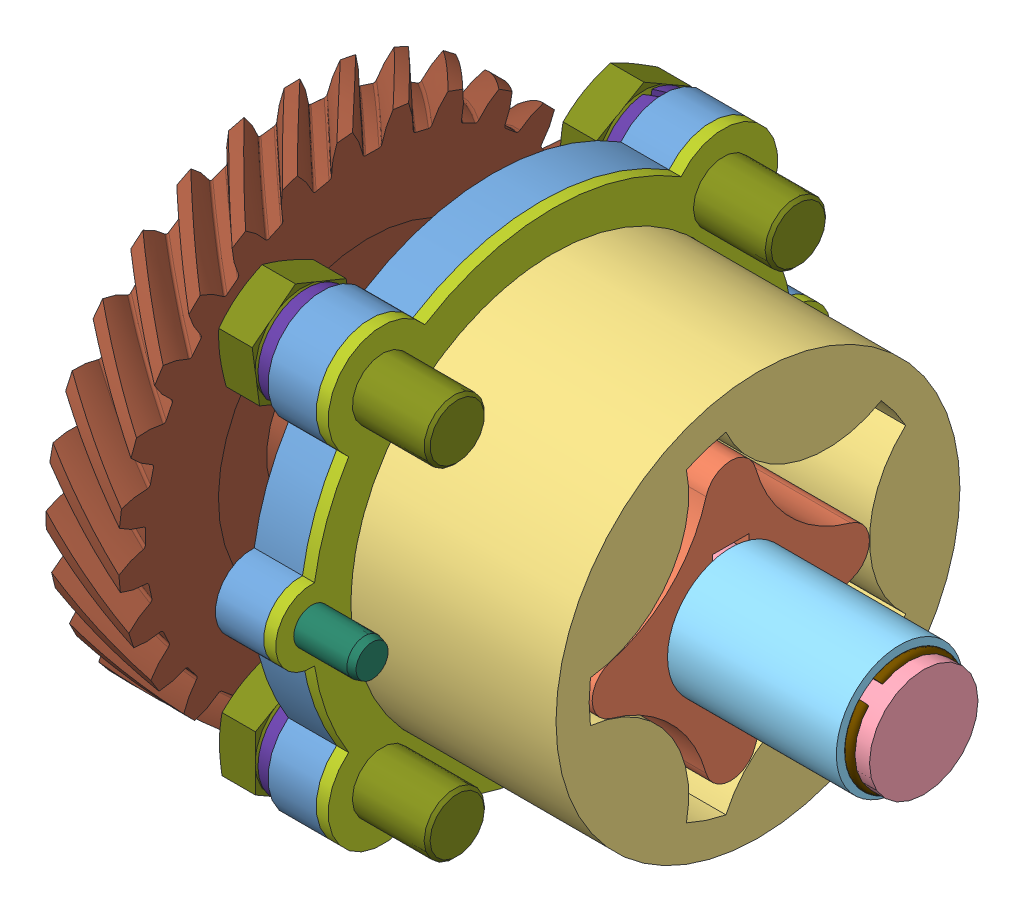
SolidWorks assembly 摆线转子泵.SLDASM, configuration 默认 (file format 3400). Lengths in mm.
Overall size (122 90.82 95.91).
26 component instances, 19 part files, 73 mates.
Components (placement in the parent):
- 泵体-1: 泵体.SLDPRT [默认] at origin size (66 97.5 150) (hidden)
- 泵盖-1: 泵盖.SLDPRT [默认] at (-62 0 0) x (0 0 1) z (-1 0 0) size (92 80 16)
- 内转子-1: 内转子.SLDPRT [默认] at (-28 0 0) x (0 0 1) z (-1 0 0) size (46 46 36)
- 外转子-1: 外转子.SLDPRT [默认] at (-28 0 0) x (0 0 1) z (-1 0 0) size (67 67 36)
- 泵轴-1: 泵轴.SLDPRT [默认] x (0 0 -1) z (1 0 0) size (18 18 122)
- 轴套1-1: 轴套1.SLDPRT [默认] x (0 0 -1) z (1 0 0) size (21 21 28)
- 轴套2-1: 轴套2.SLDPRT [默认] at (-72 0 0) x (0 0 1) z (-1 0 0) size (21 21 8)
- 垫片-1: 垫片.SLDPRT [默认] at (-62 0 0) x (0 0 1) z (-1 0 0) size (92 80 2)
- 键2-1: 键2.SLDPRT [默认] at (0 5 0) x (0 0 1) z (0 1 0) size (5 12 4)
- 键1-1: 键1.SLDPRT [默认] at (0 7 0) x (0 0 1) z (0 1 0) size (6 26 4)
- 止推轴衬-1: 止推轴衬.SLDPRT [默认] at (-82 0 0) x (0 0 1) z (-1 0 0) size (29 29 2)
- 斜齿轮.SLDPRT.lnk-1: 斜齿轮.SLDPRT.lnk.SLDPRT [ISO - RH Helical gear 2M 28T 45HA 20PA 12FW ---28A75H50L0.8N] at (-100 0 4.5) x (1 0 0) z (0 0.093312 0.995637) size (18 83.4 83.4)
- 垫圈1-1: 垫圈1.SLDPRT [默认] at (-97 0 4.5) x (0 0.093312 0.995637) z (-1 0 0) size (15 15 1)
- 螺母M12-1: 螺母M12.SLDPRT [GB_FASTENER_NUT_SNNAB1 M12 YB-N] at (-114.8 0 4.5) x (0 -0.5 0.866025) z (-1 0 0) size (20.78 18 15.8)
- 开口销-1: 开口销.SLDPRT [GB_CONNECTING_PIECE_PIN_AP 3.2X22] at (-111.925 0 20.8262) x (0 0 -1) z (0.619272 0.785177 0) size (31.6 5.8 2.9)
- 圆柱销-1: 圆柱销.SLDPRT [GB_CONNECTING_PIECE_PIN_PPUS 6X20] at (-72 0 40) x (1 0 0) z (0 0.371336 -0.928499) size (20 6 6)
- 圆柱销-2: 圆柱销.SLDPRT [GB_CONNECTING_PIECE_PIN_PPUS 6X20] at (-72 0 -40) x (1 0 0) z (0 0.371336 -0.928499) size (20 6 6)
- 螺栓-1: 螺栓.sldprt [GB_FASTENER_BOLT_STBAB A M10X25-N] at (-81.18 28.2843 28.2843) x (1 0 0) z (0 -0.134968 0.99085) size (31.58 18.16 15.73)
- 垫圈-1: 垫圈.SLDPRT [GB_FASTENER_WASHER_SW 10] at (-74.6 28.2843 28.2843) x (0 -0.815355 -0.578962) z (-1 0 0) size (16.1 16.1 2.6)
- 螺栓-2: 螺栓.sldprt [GB_FASTENER_BOLT_STBAB A M10X25-N] at (-81.18 28.2843 -28.2843) size (31.58 18.16 15.73)
- 垫圈-2: 垫圈.SLDPRT [GB_FASTENER_WASHER_SW 10] at (-72 28.2843 -28.2843) x (0 -0.090155 -0.995928) z (1 0 0) size (16.1 16.1 2.6)
- 垫圈-3: 垫圈.SLDPRT [GB_FASTENER_WASHER_SW 10] at (-72 -28.2843 -28.2843) x (0 -0.090155 -0.995928) z (1 0 0) size (16.1 16.1 2.6)
- 垫圈-4: 垫圈.SLDPRT [GB_FASTENER_WASHER_SW 10] at (-72 -28.2843 28.2843) x (0 -0.090155 -0.995928) z (1 0 0) size (16.1 16.1 2.6)
- 螺栓-3: 螺栓.sldprt [GB_FASTENER_BOLT_STBAB A M10X25-N] at (-81.18 -28.2843 -28.2843) x (1 0 0) z (0 0 -1) size (31.58 18.16 15.73)
- 螺栓-4: 螺栓.sldprt [GB_FASTENER_BOLT_STBAB A M10X25-N] at (-81.18 -28.2843 28.2843) size (31.58 18.16 15.73)
- 挡圈-1: 挡圈.SLDPRT [GB_CONNECTING_PIECE_RINGS_RSRS 18] at (0.8 0 4.5) x (0 0.627774 -0.778396) z (1 0 0) size (19.2 19.12 1.69)
Mates (geometry in assembly coordinates):
- 重合1: coincident: point of 泵体-1
- 在位1: in place: plane of 泵体-1 through (-62 0 20) normal (-1 0 0); unknown of ?
- 重合2: coincident aligned: plane of ?; plane of ?
- 重合3: coincident aligned: moOrthogonalPlaneRef_w of ?; plane of ?
- 重合4: coincident anti-aligned: moOrthogonalPlaneRef_w of ?; plane of ?
- 在位2: in place: unknown of 泵体-1; unknown of ?
- 重合5: coincident aligned: plane of ?; plane of ?
- 重合6: coincident aligned: moOrthogonalPlaneRef_w of ?; plane of ?
- 重合7: coincident anti-aligned: moOrthogonalPlaneRef_w of ?; plane of ?
- 在位3: in place: unknown of 泵体-1; unknown of ?
- 重合8: coincident aligned: plane of ?; plane of ?
- 重合9: coincident aligned: moOrthogonalPlaneRef_w of ?; plane of ?
- 重合10: coincident anti-aligned: moOrthogonalPlaneRef_w of ?; plane of ?
- 在位4: in place: unknown of 泵体-1; unknown of ?
- 重合11: coincident aligned: plane of ?; plane of ?
- 重合12: coincident aligned: moOrthogonalPlaneRef_w of ?; plane of ?
- 重合13: coincident anti-aligned: moOrthogonalPlaneRef_w of ?; plane of ?
- 在位5: in place: unknown of 泵体-1; unknown of ?
- 重合2: coincident aligned: plane of ?; plane of ?
- 重合3: coincident aligned: moOrthogonalPlaneRef_w of ?; plane of ?
- 重合4: coincident anti-aligned: moOrthogonalPlaneRef_w of ?; plane of ?
- 在位6: in place: unknown of ?; unknown of 轴套2-1
- 重合5: coincident aligned: plane of ?; plane of ?
- 重合6: coincident aligned: moOrthogonalPlaneRef_w of ?; plane of ?
- 重合7: coincident anti-aligned: moOrthogonalPlaneRef_w of ?; plane of ?
- 在位7: in place: unknown of 泵体-1; unknown of ?
- 重合2: coincident aligned: plane of ?; plane of ?
- 重合3: coincident aligned: moOrthogonalPlaneRef_w of ?; plane of ?
- 重合4: coincident anti-aligned: moOrthogonalPlaneRef_w of ?; plane of ?
- 在位8: in place: unknown of ?; unknown of 键2-1
- 重合5: coincident aligned: plane of ?; plane of ?
- 重合6: coincident aligned: moOrthogonalPlaneRef_w of ?; plane of ?
- 重合7: coincident anti-aligned: moOrthogonalPlaneRef_w of ?; plane of ?
- 在位9: in place: unknown of ?; unknown of 键1-1
- 重合8: coincident aligned: plane of ?; plane of ?
- 重合9: coincident aligned: moOrthogonalPlaneRef_w of ?; plane of ?
- 重合10: coincident anti-aligned: moOrthogonalPlaneRef_w of ?; plane of ?
- 在位10: in place: unknown of ?; unknown of 止推轴衬-1
- 重合11: coincident aligned: plane of ?; plane of ?
- 重合12: coincident aligned: moOrthogonalPlaneRef_w of ?; plane of ?
- 重合13: coincident anti-aligned: moOrthogonalPlaneRef_w of ?; plane of ?
- 重合2: coincident anti-aligned: unknown of 键2-1
- 重合3: coincident anti-aligned: unknown of 止推轴衬-1
- 在位11: in place: unknown of 垫圈1-1
- 重合4: coincident aligned: plane of ?; plane of ?
- 重合5: coincident aligned: moOrthogonalPlaneRef_w of ?; plane of ?
- 重合6: coincident anti-aligned: moOrthogonalPlaneRef_w of ?; plane of ?
- 同心3: concentric anti-aligned: cylinder of ?
- 重合7: coincident anti-aligned: unknown of 垫圈1-1
- 同心5: concentric anti-aligned: unknown of ?
- 重合8: coincident aligned: circle of ?
- 重合9: coincident aligned: unknown of ?
- 重合10: coincident aligned: unknown of ?
- 重合11: coincident aligned: unknown of ?
- 重合12: coincident anti-aligned: plane of ?; plane of ?
- 同心6: concentric aligned: cylinder of ?; cylinder of ?
- 同心7: concentric aligned: unknown of ?
- 重合13: coincident anti-aligned: unknown of ?
- 同心8: concentric anti-aligned: cylinder of ?; cylinder of ?
- 同心9: concentric anti-aligned: cylinder of ?; cylinder of ?
- 同心10: concentric anti-aligned: cylinder of ?; cylinder of ?
- 重合14: coincident anti-aligned: plane of ?; plane of ?
- 重合15: coincident anti-aligned: plane of ?; plane of ?
- 重合16: coincident anti-aligned: plane of ?; plane of ?
- 同心11: concentric aligned: unknown of ?
- 同心12: concentric aligned: unknown of ?
- 同心13: concentric aligned: unknown of ?
- 重合17: coincident anti-aligned: unknown of ?
- 重合18: coincident anti-aligned: unknown of ?
- 重合19: coincident anti-aligned: unknown of ?
- 同心14: concentric aligned: cylinder of ?; circle of ?
- 同心15: concentric anti-aligned: cylinder of ?; circle of ?
- 相切2: tangent: plane of ?; face of ?
